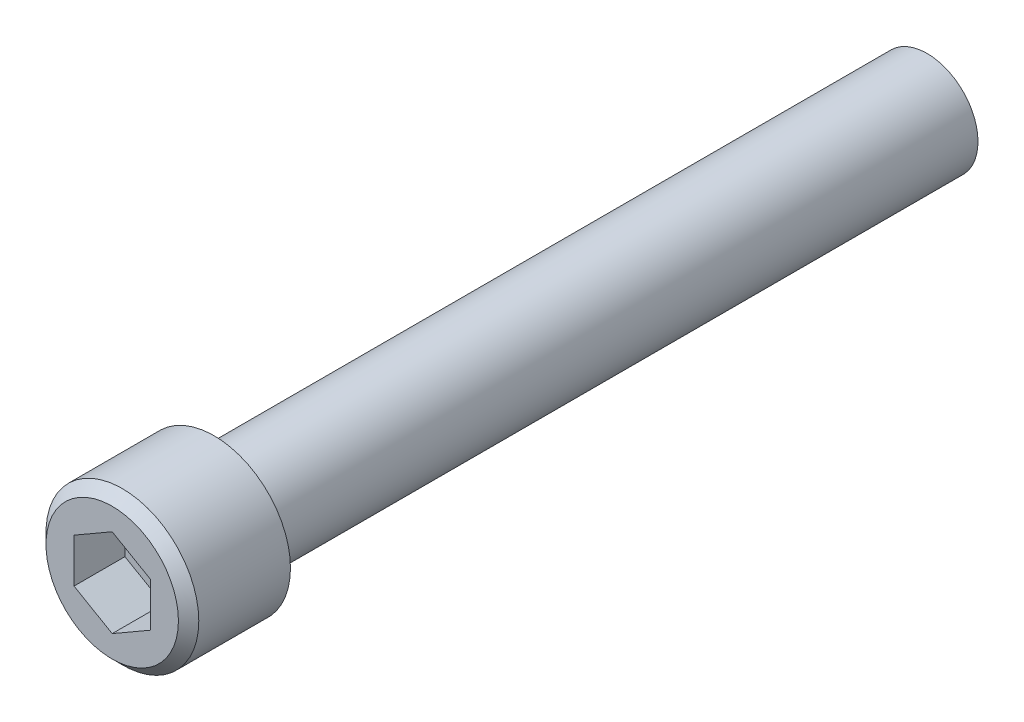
ISO-10303-21;
HEADER;
FILE_DESCRIPTION(('STEP AP214'),'2;1');
FILE_NAME('part.step','',(''),(''),'','','');
FILE_SCHEMA(('AUTOMOTIVE_DESIGN { 1 0 10303 214 1 1 1 1 }'));
ENDSEC;
DATA;
#1=APPLICATION_CONTEXT('core data for automotive mechanical design processes');
#2=APPLICATION_PROTOCOL_DEFINITION('international standard','automotive_design',2000,#1);
#3=PRODUCT_CONTEXT('',#1,'mechanical');
#4=PRODUCT('Part','Part','',(#3));
#5=PRODUCT_RELATED_PRODUCT_CATEGORY('part','',(#4));
#6=PRODUCT_DEFINITION_FORMATION('','',#4);
#7=PRODUCT_DEFINITION_CONTEXT('part definition',#1,'design');
#8=PRODUCT_DEFINITION('design','',#6,#7);
#9=PRODUCT_DEFINITION_SHAPE('','',#8);
#10=(LENGTH_UNIT() NAMED_UNIT(*) SI_UNIT(.MILLI.,.METRE.));
#11=(NAMED_UNIT(*) PLANE_ANGLE_UNIT() SI_UNIT($,.RADIAN.));
#12=(NAMED_UNIT(*) SI_UNIT($,.STERADIAN.) SOLID_ANGLE_UNIT());
#13=UNCERTAINTY_MEASURE_WITH_UNIT(LENGTH_MEASURE(1.E-05),#10,'distance_accuracy_value','');
#14=(GEOMETRIC_REPRESENTATION_CONTEXT(3) GLOBAL_UNCERTAINTY_ASSIGNED_CONTEXT((#13)) GLOBAL_UNIT_ASSIGNED_CONTEXT((#10,
#11,#12)) REPRESENTATION_CONTEXT('',''));
#15=CARTESIAN_POINT('',(0.,0.,0.));
#16=DIRECTION('',(0.,0.,1.));
#17=DIRECTION('',(1.,0.,0.));
#18=AXIS2_PLACEMENT_3D('',#15,#16,#17);
#19=CARTESIAN_POINT('',(0.,0.,44.45));
#20=DIRECTION('',(0.,0.,-1.));
#21=DIRECTION('',(-1.,0.,0.));
#22=AXIS2_PLACEMENT_3D('',#19,#20,#21);
#23=CYLINDRICAL_SURFACE('',#22,3.175);
#24=CARTESIAN_POINT('',(0.,0.,44.0944));
#25=DIRECTION('',(0.,0.,1.));
#26=DIRECTION('',(1.,0.,0.));
#27=AXIS2_PLACEMENT_3D('',#24,#25,#26);
#28=CIRCLE('',#27,3.175);
#29=CARTESIAN_POINT('',(3.175,0.,44.0944));
#30=VERTEX_POINT('',#29);
#31=EDGE_CURVE('E152',#30,#30,#28,.F.);
#32=ORIENTED_EDGE('',*,*,#31,.T.);
#33=EDGE_LOOP('',(#32));
#34=FACE_BOUND('',#33,.T.);
#35=CARTESIAN_POINT('',(0.,0.,0.));
#36=DIRECTION('',(0.,0.,1.));
#37=DIRECTION('',(1.,0.,0.));
#38=AXIS2_PLACEMENT_3D('',#35,#36,#37);
#39=CIRCLE('',#38,3.175);
#40=CARTESIAN_POINT('',(3.175,0.,0.));
#41=VERTEX_POINT('',#40);
#42=EDGE_CURVE('E146',#41,#41,#39,.T.);
#43=ORIENTED_EDGE('',*,*,#42,.T.);
#44=EDGE_LOOP('',(#43));
#45=FACE_BOUND('',#44,.T.);
#46=ADVANCED_FACE('F36',(#34,#45),#23,.T.);
#47=CARTESIAN_POINT('',(0.,0.,0.));
#48=DIRECTION('',(0.,0.,1.));
#49=DIRECTION('',(1.,0.,0.));
#50=AXIS2_PLACEMENT_3D('',#47,#48,#49);
#51=PLANE('',#50);
#52=ORIENTED_EDGE('',*,*,#42,.F.);
#53=EDGE_LOOP('',(#52));
#54=FACE_BOUND('',#53,.T.);
#55=ADVANCED_FACE('F169',(#54),#51,.F.);
#56=CARTESIAN_POINT('',(0.,0.,50.8));
#57=DIRECTION('',(0.,0.,-1.));
#58=DIRECTION('',(-1.,0.,0.));
#59=AXIS2_PLACEMENT_3D('',#56,#57,#58);
#60=CYLINDRICAL_SURFACE('',#59,4.7625);
#61=CARTESIAN_POINT('',(0.,0.,50.165));
#62=DIRECTION('',(0.,0.,1.));
#63=DIRECTION('',(1.,0.,0.));
#64=AXIS2_PLACEMENT_3D('',#61,#62,#63);
#65=CIRCLE('',#64,4.7625);
#66=CARTESIAN_POINT('',(4.7625,0.,50.165));
#67=VERTEX_POINT('',#66);
#68=EDGE_CURVE('E11',#67,#67,#65,.F.);
#69=ORIENTED_EDGE('',*,*,#68,.T.);
#70=EDGE_LOOP('',(#69));
#71=FACE_BOUND('',#70,.T.);
#72=CARTESIAN_POINT('',(0.,0.,44.45));
#73=DIRECTION('',(0.,0.,1.));
#74=DIRECTION('',(1.,0.,0.));
#75=AXIS2_PLACEMENT_3D('',#72,#73,#74);
#76=CIRCLE('',#75,4.7625);
#77=CARTESIAN_POINT('',(4.7625,0.,44.45));
#78=VERTEX_POINT('',#77);
#79=EDGE_CURVE('E138',#78,#78,#76,.T.);
#80=ORIENTED_EDGE('',*,*,#79,.T.);
#81=EDGE_LOOP('',(#80));
#82=FACE_BOUND('',#81,.T.);
#83=ADVANCED_FACE('F175',(#71,#82),#60,.T.);
#84=CARTESIAN_POINT('',(0.,0.,50.8));
#85=DIRECTION('',(0.,0.,1.));
#86=DIRECTION('',(1.,0.,0.));
#87=AXIS2_PLACEMENT_3D('',#84,#85,#86);
#88=PLANE('',#87);
#89=CARTESIAN_POINT('',(0.,0.,50.8));
#90=DIRECTION('',(0.,0.,1.));
#91=DIRECTION('',(1.,0.,0.));
#92=AXIS2_PLACEMENT_3D('',#89,#90,#91);
#93=CIRCLE('',#92,4.12749999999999);
#94=CARTESIAN_POINT('',(4.12749999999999,0.,50.8));
#95=VERTEX_POINT('',#94);
#96=EDGE_CURVE('E44',#95,#95,#93,.T.);
#97=ORIENTED_EDGE('',*,*,#96,.T.);
#98=EDGE_LOOP('',(#97));
#99=FACE_BOUND('',#98,.T.);
#100=DIRECTION('',(-0.866025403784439,-0.5,0.));
#101=VECTOR('',#100,1.);
#102=CARTESIAN_POINT('',(0.,2.74963065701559,50.8000000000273));
#103=LINE('',#102,#101);
#104=CARTESIAN_POINT('',(0.,2.74963065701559,50.8000000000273));
#105=VERTEX_POINT('',#104);
#106=CARTESIAN_POINT('',(-2.38125,1.3748153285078,50.8));
#107=VERTEX_POINT('',#106);
#108=EDGE_CURVE('E51',#105,#107,#103,.T.);
#109=ORIENTED_EDGE('',*,*,#108,.F.);
#110=DIRECTION('',(0.866025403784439,-0.499999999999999,0.));
#111=VECTOR('',#110,1.);
#112=CARTESIAN_POINT('',(0.,2.74963065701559,50.8000000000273));
#113=LINE('',#112,#111);
#114=CARTESIAN_POINT('',(2.38125,1.3748153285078,50.8000000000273));
#115=VERTEX_POINT('',#114);
#116=EDGE_CURVE('E133',#105,#115,#113,.T.);
#117=ORIENTED_EDGE('',*,*,#116,.T.);
#118=DIRECTION('',(0.,-1.,0.));
#119=VECTOR('',#118,1.);
#120=CARTESIAN_POINT('',(2.38125,1.3748153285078,50.8000000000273));
#121=LINE('',#120,#119);
#122=CARTESIAN_POINT('',(2.38125,-1.3748153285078,50.8000000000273));
#123=VERTEX_POINT('',#122);
#124=EDGE_CURVE('E131',#115,#123,#121,.T.);
#125=ORIENTED_EDGE('',*,*,#124,.T.);
#126=DIRECTION('',(0.866025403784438,0.500000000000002,0.));
#127=VECTOR('',#126,1.);
#128=CARTESIAN_POINT('',(0.,-2.7496306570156,50.8000000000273));
#129=LINE('',#128,#127);
#130=CARTESIAN_POINT('',(0.,-2.7496306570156,50.8000000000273));
#131=VERTEX_POINT('',#130);
#132=EDGE_CURVE('E108',#131,#123,#129,.T.);
#133=ORIENTED_EDGE('',*,*,#132,.F.);
#134=DIRECTION('',(-0.866025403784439,0.5,0.));
#135=VECTOR('',#134,1.);
#136=CARTESIAN_POINT('',(0.,-2.7496306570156,50.8000000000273));
#137=LINE('',#136,#135);
#138=CARTESIAN_POINT('',(-2.38125,-1.3748153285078,50.8000000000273));
#139=VERTEX_POINT('',#138);
#140=EDGE_CURVE('E127',#131,#139,#137,.T.);
#141=ORIENTED_EDGE('',*,*,#140,.T.);
#142=DIRECTION('',(0.,-1.,0.));
#143=VECTOR('',#142,1.);
#144=CARTESIAN_POINT('',(-2.38125,1.3748153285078,50.8000000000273));
#145=LINE('',#144,#143);
#146=EDGE_CURVE('E124',#107,#139,#145,.T.);
#147=ORIENTED_EDGE('',*,*,#146,.F.);
#148=EDGE_LOOP('',(#109,#117,#125,#133,#141,#147));
#149=FACE_BOUND('',#148,.T.);
#150=ADVANCED_FACE('F157',(#99,#149),#88,.T.);
#151=CARTESIAN_POINT('',(0.,0.,44.45));
#152=DIRECTION('',(0.,0.,1.));
#153=DIRECTION('',(1.,0.,0.));
#154=AXIS2_PLACEMENT_3D('',#151,#152,#153);
#155=PLANE('',#154);
#156=CARTESIAN_POINT('',(0.,0.,44.45));
#157=DIRECTION('',(0.,0.,1.));
#158=DIRECTION('',(1.,0.,0.));
#159=AXIS2_PLACEMENT_3D('',#156,#157,#158);
#160=CIRCLE('',#159,3.5306);
#161=CARTESIAN_POINT('',(3.5306,0.,44.45));
#162=VERTEX_POINT('',#161);
#163=EDGE_CURVE('E149',#162,#162,#160,.T.);
#164=ORIENTED_EDGE('',*,*,#163,.T.);
#165=EDGE_LOOP('',(#164));
#166=FACE_BOUND('',#165,.T.);
#167=ORIENTED_EDGE('',*,*,#79,.F.);
#168=EDGE_LOOP('',(#167));
#169=FACE_BOUND('',#168,.T.);
#170=ADVANCED_FACE('F183',(#166,#169),#155,.F.);
#171=CARTESIAN_POINT('',(0.,0.,44.0944));
#172=DIRECTION('',(0.,0.,1.));
#173=DIRECTION('',(1.,0.,0.));
#174=AXIS2_PLACEMENT_3D('',#171,#172,#173);
#175=TOROIDAL_SURFACE('',#174,3.5306,0.3556);
#176=ORIENTED_EDGE('',*,*,#31,.F.);
#177=EDGE_LOOP('',(#176));
#178=FACE_BOUND('',#177,.T.);
#179=ORIENTED_EDGE('',*,*,#163,.F.);
#180=EDGE_LOOP('',(#179));
#181=FACE_BOUND('',#180,.T.);
#182=ADVANCED_FACE('F180',(#178,#181),#175,.F.);
#183=CARTESIAN_POINT('',(0.,2.74963065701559,47.6250000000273));
#184=DIRECTION('',(-0.5,0.866025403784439,0.));
#185=DIRECTION('',(-0.866025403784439,-0.5,0.));
#186=AXIS2_PLACEMENT_3D('',#183,#184,#185);
#187=PLANE('',#186);
#188=ORIENTED_EDGE('',*,*,#108,.T.);
#189=DIRECTION('',(0.,0.,1.));
#190=VECTOR('',#189,1.);
#191=CARTESIAN_POINT('',(-2.38125,1.3748153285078,47.6250000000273));
#192=LINE('',#191,#190);
#193=CARTESIAN_POINT('',(-2.38125,1.3748153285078,47.6250000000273));
#194=VERTEX_POINT('',#193);
#195=EDGE_CURVE('E81',#194,#107,#192,.T.);
#196=ORIENTED_EDGE('',*,*,#195,.F.);
#197=DIRECTION('',(-0.866025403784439,-0.5,0.));
#198=VECTOR('',#197,1.);
#199=CARTESIAN_POINT('',(0.,2.74963065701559,47.6250000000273));
#200=LINE('',#199,#198);
#201=CARTESIAN_POINT('',(0.,2.74963065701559,47.6250000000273));
#202=VERTEX_POINT('',#201);
#203=EDGE_CURVE('E136',#202,#194,#200,.T.);
#204=ORIENTED_EDGE('',*,*,#203,.F.);
#205=DIRECTION('',(0.,0.,1.));
#206=VECTOR('',#205,1.);
#207=CARTESIAN_POINT('',(0.,2.74963065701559,47.6250000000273));
#208=LINE('',#207,#206);
#209=EDGE_CURVE('E59',#202,#105,#208,.T.);
#210=ORIENTED_EDGE('',*,*,#209,.T.);
#211=EDGE_LOOP('',(#188,#196,#204,#210));
#212=FACE_BOUND('',#211,.T.);
#213=ADVANCED_FACE('F182',(#212),#187,.F.);
#214=CARTESIAN_POINT('',(0.,2.74963065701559,47.6250000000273));
#215=DIRECTION('',(-0.499999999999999,-0.866025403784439,0.));
#216=DIRECTION('',(0.866025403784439,-0.5,0.));
#217=AXIS2_PLACEMENT_3D('',#214,#215,#216);
#218=PLANE('',#217);
#219=ORIENTED_EDGE('',*,*,#116,.F.);
#220=ORIENTED_EDGE('',*,*,#209,.F.);
#221=DIRECTION('',(0.866025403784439,-0.499999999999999,0.));
#222=VECTOR('',#221,1.);
#223=CARTESIAN_POINT('',(0.,2.74963065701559,47.6250000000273));
#224=LINE('',#223,#222);
#225=CARTESIAN_POINT('',(2.38125,1.3748153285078,47.6250000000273));
#226=VERTEX_POINT('',#225);
#227=EDGE_CURVE('E101',#202,#226,#224,.T.);
#228=ORIENTED_EDGE('',*,*,#227,.T.);
#229=DIRECTION('',(0.,0.,1.));
#230=VECTOR('',#229,1.);
#231=CARTESIAN_POINT('',(2.38125,1.3748153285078,47.6250000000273));
#232=LINE('',#231,#230);
#233=EDGE_CURVE('E98',#226,#115,#232,.T.);
#234=ORIENTED_EDGE('',*,*,#233,.T.);
#235=EDGE_LOOP('',(#219,#220,#228,#234));
#236=FACE_BOUND('',#235,.T.);
#237=ADVANCED_FACE('F189',(#236),#218,.T.);
#238=CARTESIAN_POINT('',(2.38125,1.3748153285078,47.6250000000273));
#239=DIRECTION('',(-1.,0.,0.));
#240=DIRECTION('',(0.,0.,1.));
#241=AXIS2_PLACEMENT_3D('',#238,#239,#240);
#242=PLANE('',#241);
#243=ORIENTED_EDGE('',*,*,#124,.F.);
#244=ORIENTED_EDGE('',*,*,#233,.F.);
#245=DIRECTION('',(0.,-1.,0.));
#246=VECTOR('',#245,1.);
#247=CARTESIAN_POINT('',(2.38125,1.3748153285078,47.6250000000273));
#248=LINE('',#247,#246);
#249=CARTESIAN_POINT('',(2.38125,-1.3748153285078,47.6250000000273));
#250=VERTEX_POINT('',#249);
#251=EDGE_CURVE('E92',#226,#250,#248,.T.);
#252=ORIENTED_EDGE('',*,*,#251,.T.);
#253=DIRECTION('',(0.,0.,1.));
#254=VECTOR('',#253,1.);
#255=CARTESIAN_POINT('',(2.38125,-1.3748153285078,47.6250000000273));
#256=LINE('',#255,#254);
#257=EDGE_CURVE('E96',#250,#123,#256,.T.);
#258=ORIENTED_EDGE('',*,*,#257,.T.);
#259=EDGE_LOOP('',(#243,#244,#252,#258));
#260=FACE_BOUND('',#259,.T.);
#261=ADVANCED_FACE('F95',(#260),#242,.T.);
#262=CARTESIAN_POINT('',(0.,-2.7496306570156,47.6250000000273));
#263=DIRECTION('',(0.500000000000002,-0.866025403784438,0.));
#264=DIRECTION('',(0.866025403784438,0.500000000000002,0.));
#265=AXIS2_PLACEMENT_3D('',#262,#263,#264);
#266=PLANE('',#265);
#267=ORIENTED_EDGE('',*,*,#132,.T.);
#268=ORIENTED_EDGE('',*,*,#257,.F.);
#269=DIRECTION('',(0.866025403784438,0.500000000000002,0.));
#270=VECTOR('',#269,1.);
#271=CARTESIAN_POINT('',(0.,-2.7496306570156,47.6250000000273));
#272=LINE('',#271,#270);
#273=CARTESIAN_POINT('',(0.,-2.7496306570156,47.6250000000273));
#274=VERTEX_POINT('',#273);
#275=EDGE_CURVE('E102',#274,#250,#272,.T.);
#276=ORIENTED_EDGE('',*,*,#275,.F.);
#277=DIRECTION('',(0.,0.,1.));
#278=VECTOR('',#277,1.);
#279=CARTESIAN_POINT('',(0.,-2.7496306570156,47.6250000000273));
#280=LINE('',#279,#278);
#281=EDGE_CURVE('E110',#274,#131,#280,.T.);
#282=ORIENTED_EDGE('',*,*,#281,.T.);
#283=EDGE_LOOP('',(#267,#268,#276,#282));
#284=FACE_BOUND('',#283,.T.);
#285=ADVANCED_FACE('F106',(#284),#266,.F.);
#286=CARTESIAN_POINT('',(0.,-2.7496306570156,47.6250000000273));
#287=DIRECTION('',(0.5,0.866025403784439,0.));
#288=DIRECTION('',(-0.866025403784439,0.5,0.));
#289=AXIS2_PLACEMENT_3D('',#286,#287,#288);
#290=PLANE('',#289);
#291=ORIENTED_EDGE('',*,*,#140,.F.);
#292=ORIENTED_EDGE('',*,*,#281,.F.);
#293=DIRECTION('',(-0.866025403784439,0.5,0.));
#294=VECTOR('',#293,1.);
#295=CARTESIAN_POINT('',(0.,-2.7496306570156,47.6250000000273));
#296=LINE('',#295,#294);
#297=CARTESIAN_POINT('',(-2.38125,-1.3748153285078,47.6250000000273));
#298=VERTEX_POINT('',#297);
#299=EDGE_CURVE('E116',#274,#298,#296,.T.);
#300=ORIENTED_EDGE('',*,*,#299,.T.);
#301=DIRECTION('',(0.,0.,1.));
#302=VECTOR('',#301,1.);
#303=CARTESIAN_POINT('',(-2.38125,-1.3748153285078,47.6250000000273));
#304=LINE('',#303,#302);
#305=EDGE_CURVE('E141',#298,#139,#304,.T.);
#306=ORIENTED_EDGE('',*,*,#305,.T.);
#307=EDGE_LOOP('',(#291,#292,#300,#306));
#308=FACE_BOUND('',#307,.T.);
#309=ADVANCED_FACE('F208',(#308),#290,.T.);
#310=CARTESIAN_POINT('',(-2.38125,1.3748153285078,47.6250000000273));
#311=DIRECTION('',(-1.,0.,0.));
#312=DIRECTION('',(0.,0.,1.));
#313=AXIS2_PLACEMENT_3D('',#310,#311,#312);
#314=PLANE('',#313);
#315=ORIENTED_EDGE('',*,*,#146,.T.);
#316=ORIENTED_EDGE('',*,*,#305,.F.);
#317=DIRECTION('',(0.,-1.,0.));
#318=VECTOR('',#317,1.);
#319=CARTESIAN_POINT('',(-2.38125,1.3748153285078,47.6250000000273));
#320=LINE('',#319,#318);
#321=EDGE_CURVE('E118',#194,#298,#320,.T.);
#322=ORIENTED_EDGE('',*,*,#321,.F.);
#323=ORIENTED_EDGE('',*,*,#195,.T.);
#324=EDGE_LOOP('',(#315,#316,#322,#323));
#325=FACE_BOUND('',#324,.T.);
#326=ADVANCED_FACE('F165',(#325),#314,.F.);
#327=CARTESIAN_POINT('',(-2.38125,1.3748153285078,47.6250000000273));
#328=DIRECTION('',(0.,0.,1.));
#329=DIRECTION('',(1.,0.,0.));
#330=AXIS2_PLACEMENT_3D('',#327,#328,#329);
#331=PLANE('',#330);
#332=ORIENTED_EDGE('',*,*,#203,.T.);
#333=ORIENTED_EDGE('',*,*,#321,.T.);
#334=ORIENTED_EDGE('',*,*,#299,.F.);
#335=ORIENTED_EDGE('',*,*,#275,.T.);
#336=ORIENTED_EDGE('',*,*,#251,.F.);
#337=ORIENTED_EDGE('',*,*,#227,.F.);
#338=EDGE_LOOP('',(#332,#333,#334,#335,#336,#337));
#339=FACE_BOUND('',#338,.T.);
#340=ADVANCED_FACE('F114',(#339),#331,.T.);
#341=CARTESIAN_POINT('',(0.,0.,50.8));
#342=DIRECTION('',(0.,0.,-1.));
#343=DIRECTION('',(-1.,0.,0.));
#344=AXIS2_PLACEMENT_3D('',#341,#342,#343);
#345=CONICAL_SURFACE('',#344,4.12749999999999,0.785398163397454);
#346=ORIENTED_EDGE('',*,*,#68,.F.);
#347=EDGE_LOOP('',(#346));
#348=FACE_BOUND('',#347,.T.);
#349=ORIENTED_EDGE('',*,*,#96,.F.);
#350=EDGE_LOOP('',(#349));
#351=FACE_BOUND('',#350,.T.);
#352=ADVANCED_FACE('F38',(#348,#351),#345,.T.);
#353=CLOSED_SHELL('',(#46,#55,#83,#150,#170,#182,#213,#237,#261,#285,#309,#326,#340,#352));
#354=MANIFOLD_SOLID_BREP('B2',#353);
#355=ADVANCED_BREP_SHAPE_REPRESENTATION('',(#18,#354),#14);
#356=SHAPE_DEFINITION_REPRESENTATION(#9,#355);
ENDSEC;
END-ISO-10303-21;
